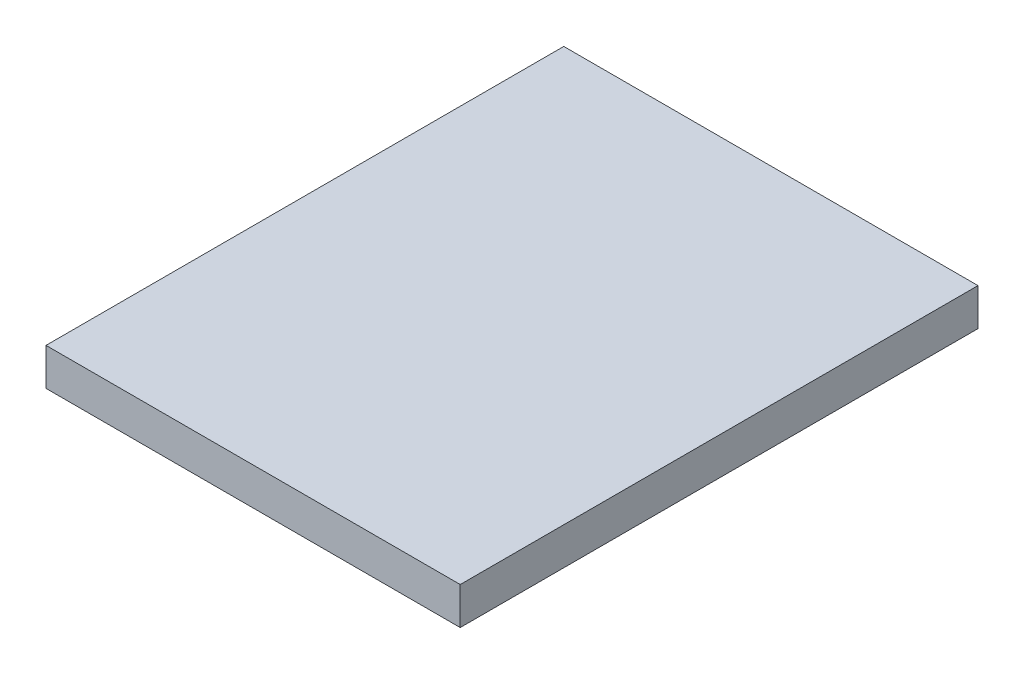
from build123d import *

# Parameters (mm, degrees)
SKETCH1_W           = 200
SKETCH1_H           = 250
BOSS_EXTRUDE1_DEPTH = 18
HOLE1_D             = 2
HOLE1_DEPTH         = 10
HOLE1_CBORE_D       = 10
HOLE1_CBORE_DEPTH   = 4


with BuildPart() as part:
    # Sketch1 → Boss-Extrude1 (new body)
    with BuildSketch(Plane(origin=(0, 0, 0), x_dir=(1, 0, 0), z_dir=(0, 1, 0))):
        Rectangle(SKETCH1_W, SKETCH1_H)
    extrude(amount=BOSS_EXTRUDE1_DEPTH)

    # Hole1
    with Locations(Plane(origin=(0, 0, 0), x_dir=(-1, 0, 0), z_dir=(0, -1, 0))):
        with Locations((-4.658742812, -67.613335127), (17.386664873, -89.658742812), (-12.727922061, -97.727922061)):
            CounterBoreHole(HOLE1_D / 2, HOLE1_CBORE_D / 2, HOLE1_CBORE_DEPTH, depth=HOLE1_DEPTH)


solid = part.part
